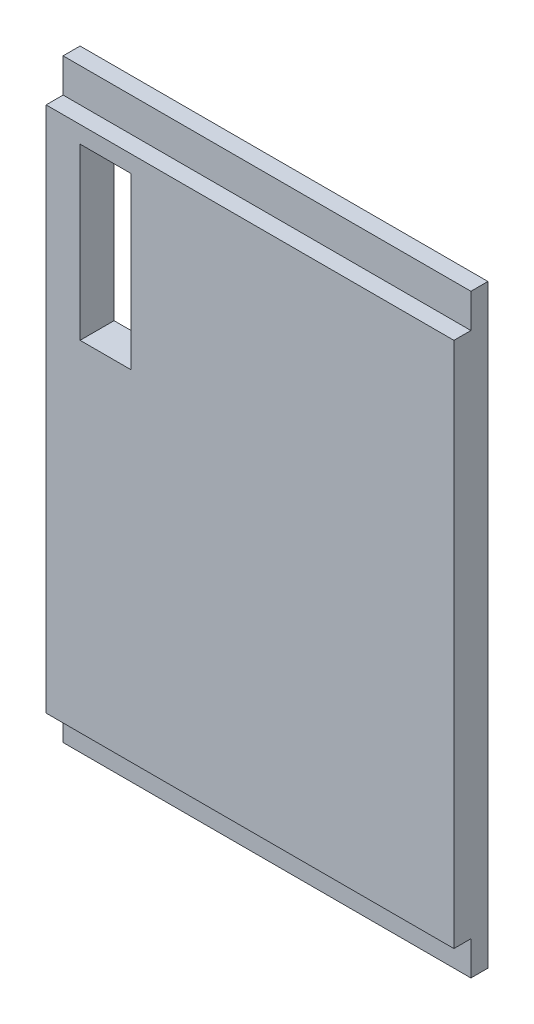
ISO-10303-21;
HEADER;
FILE_DESCRIPTION(('STEP AP214'),'2;1');
FILE_NAME('part.step','',(''),(''),'','','');
FILE_SCHEMA(('AUTOMOTIVE_DESIGN { 1 0 10303 214 1 1 1 1 }'));
ENDSEC;
DATA;
#1=APPLICATION_CONTEXT('core data for automotive mechanical design processes');
#2=APPLICATION_PROTOCOL_DEFINITION('international standard','automotive_design',2000,#1);
#3=PRODUCT_CONTEXT('',#1,'mechanical');
#4=PRODUCT('Part','Part','',(#3));
#5=PRODUCT_RELATED_PRODUCT_CATEGORY('part','',(#4));
#6=PRODUCT_DEFINITION_FORMATION('','',#4);
#7=PRODUCT_DEFINITION_CONTEXT('part definition',#1,'design');
#8=PRODUCT_DEFINITION('design','',#6,#7);
#9=PRODUCT_DEFINITION_SHAPE('','',#8);
#10=(LENGTH_UNIT() NAMED_UNIT(*) SI_UNIT(.MILLI.,.METRE.));
#11=(NAMED_UNIT(*) PLANE_ANGLE_UNIT() SI_UNIT($,.RADIAN.));
#12=(NAMED_UNIT(*) SI_UNIT($,.STERADIAN.) SOLID_ANGLE_UNIT());
#13=UNCERTAINTY_MEASURE_WITH_UNIT(LENGTH_MEASURE(1.E-05),#10,'distance_accuracy_value','');
#14=(GEOMETRIC_REPRESENTATION_CONTEXT(3) GLOBAL_UNCERTAINTY_ASSIGNED_CONTEXT((#13)) GLOBAL_UNIT_ASSIGNED_CONTEXT((#10,
#11,#12)) REPRESENTATION_CONTEXT('',''));
#15=CARTESIAN_POINT('',(0.,0.,0.));
#16=DIRECTION('',(0.,0.,1.));
#17=DIRECTION('',(1.,0.,0.));
#18=AXIS2_PLACEMENT_3D('',#15,#16,#17);
#19=CARTESIAN_POINT('',(0.,0.,1.));
#20=DIRECTION('',(0.,0.,-1.));
#21=DIRECTION('',(-1.,0.,0.));
#22=AXIS2_PLACEMENT_3D('',#19,#20,#21);
#23=PLANE('',#22);
#24=DIRECTION('',(1.,0.,0.));
#25=VECTOR('',#24,1.);
#26=CARTESIAN_POINT('',(-12.,-15.5,1.));
#27=LINE('',#26,#25);
#28=CARTESIAN_POINT('',(-12.,-15.5,1.));
#29=VERTEX_POINT('',#28);
#30=CARTESIAN_POINT('',(12.,-15.5,1.));
#31=VERTEX_POINT('',#30);
#32=EDGE_CURVE('E166',#29,#31,#27,.T.);
#33=ORIENTED_EDGE('',*,*,#32,.F.);
#34=DIRECTION('',(0.,-1.,0.));
#35=VECTOR('',#34,1.);
#36=CARTESIAN_POINT('',(-12.,-17.5,1.));
#37=LINE('',#36,#35);
#38=CARTESIAN_POINT('',(-12.,-17.5,1.));
#39=VERTEX_POINT('',#38);
#40=EDGE_CURVE('E194',#29,#39,#37,.T.);
#41=ORIENTED_EDGE('',*,*,#40,.T.);
#42=DIRECTION('',(1.,0.,0.));
#43=VECTOR('',#42,1.);
#44=CARTESIAN_POINT('',(-12.,-17.5,1.));
#45=LINE('',#44,#43);
#46=CARTESIAN_POINT('',(12.,-17.5,1.));
#47=VERTEX_POINT('',#46);
#48=EDGE_CURVE('E197',#39,#47,#45,.T.);
#49=ORIENTED_EDGE('',*,*,#48,.T.);
#50=DIRECTION('',(0.,1.,0.));
#51=VECTOR('',#50,1.);
#52=CARTESIAN_POINT('',(12.,-17.5,1.));
#53=LINE('',#52,#51);
#54=EDGE_CURVE('E189',#47,#31,#53,.T.);
#55=ORIENTED_EDGE('',*,*,#54,.T.);
#56=EDGE_LOOP('',(#33,#41,#49,#55));
#57=FACE_BOUND('',#56,.T.);
#58=ADVANCED_FACE('F36',(#57),#23,.F.);
#59=DIRECTION('',(-1.,0.,0.));
#60=VECTOR('',#59,1.);
#61=CARTESIAN_POINT('',(-12.,15.5,1.));
#62=LINE('',#61,#60);
#63=CARTESIAN_POINT('',(12.,15.5,1.));
#64=VERTEX_POINT('',#63);
#65=CARTESIAN_POINT('',(-12.,15.5,1.));
#66=VERTEX_POINT('',#65);
#67=EDGE_CURVE('E158',#64,#66,#62,.T.);
#68=ORIENTED_EDGE('',*,*,#67,.F.);
#69=CARTESIAN_POINT('',(12.,17.5,1.));
#70=VERTEX_POINT('',#69);
#71=EDGE_CURVE('E192',#64,#70,#53,.T.);
#72=ORIENTED_EDGE('',*,*,#71,.T.);
#73=DIRECTION('',(-1.,0.,0.));
#74=VECTOR('',#73,1.);
#75=CARTESIAN_POINT('',(-12.,17.5,1.));
#76=LINE('',#75,#74);
#77=CARTESIAN_POINT('',(-12.,17.5,1.));
#78=VERTEX_POINT('',#77);
#79=EDGE_CURVE('E191',#70,#78,#76,.T.);
#80=ORIENTED_EDGE('',*,*,#79,.T.);
#81=EDGE_CURVE('E195',#78,#66,#37,.T.);
#82=ORIENTED_EDGE('',*,*,#81,.T.);
#83=EDGE_LOOP('',(#68,#72,#80,#82));
#84=FACE_BOUND('',#83,.T.);
#85=ADVANCED_FACE('F247',(#84),#23,.F.);
#86=CARTESIAN_POINT('',(12.,-17.5,1.));
#87=DIRECTION('',(-1.,0.,0.));
#88=DIRECTION('',(0.,0.,1.));
#89=AXIS2_PLACEMENT_3D('',#86,#87,#88);
#90=PLANE('',#89);
#91=DIRECTION('',(0.,1.,0.));
#92=VECTOR('',#91,1.);
#93=CARTESIAN_POINT('',(12.,-17.5,0.));
#94=LINE('',#93,#92);
#95=CARTESIAN_POINT('',(12.,-17.5,0.));
#96=VERTEX_POINT('',#95);
#97=CARTESIAN_POINT('',(12.,17.5,0.));
#98=VERTEX_POINT('',#97);
#99=EDGE_CURVE('E188',#96,#98,#94,.T.);
#100=ORIENTED_EDGE('',*,*,#99,.T.);
#101=DIRECTION('',(0.,0.,-1.));
#102=VECTOR('',#101,1.);
#103=CARTESIAN_POINT('',(12.,17.5,1.));
#104=LINE('',#103,#102);
#105=EDGE_CURVE('E11',#70,#98,#104,.T.);
#106=ORIENTED_EDGE('',*,*,#105,.F.);
#107=ORIENTED_EDGE('',*,*,#71,.F.);
#108=DIRECTION('',(0.,0.,-1.));
#109=VECTOR('',#108,1.);
#110=CARTESIAN_POINT('',(12.,15.5,2.));
#111=LINE('',#110,#109);
#112=CARTESIAN_POINT('',(12.,15.5,2.));
#113=VERTEX_POINT('',#112);
#114=EDGE_CURVE('E185',#113,#64,#111,.T.);
#115=ORIENTED_EDGE('',*,*,#114,.F.);
#116=DIRECTION('',(0.,1.,0.));
#117=VECTOR('',#116,1.);
#118=CARTESIAN_POINT('',(12.,-15.5,2.));
#119=LINE('',#118,#117);
#120=CARTESIAN_POINT('',(12.,-15.5,2.));
#121=VERTEX_POINT('',#120);
#122=EDGE_CURVE('E162',#121,#113,#119,.T.);
#123=ORIENTED_EDGE('',*,*,#122,.F.);
#124=DIRECTION('',(0.,0.,-1.));
#125=VECTOR('',#124,1.);
#126=CARTESIAN_POINT('',(12.,-15.5,2.));
#127=LINE('',#126,#125);
#128=EDGE_CURVE('E172',#121,#31,#127,.T.);
#129=ORIENTED_EDGE('',*,*,#128,.T.);
#130=ORIENTED_EDGE('',*,*,#54,.F.);
#131=DIRECTION('',(0.,0.,-1.));
#132=VECTOR('',#131,1.);
#133=CARTESIAN_POINT('',(12.,-17.5,1.));
#134=LINE('',#133,#132);
#135=EDGE_CURVE('E199',#47,#96,#134,.T.);
#136=ORIENTED_EDGE('',*,*,#135,.T.);
#137=EDGE_LOOP('',(#100,#106,#107,#115,#123,#129,#130,#136));
#138=FACE_BOUND('',#137,.T.);
#139=ADVANCED_FACE('F38',(#138),#90,.F.);
#140=CARTESIAN_POINT('',(-12.,17.5,1.));
#141=DIRECTION('',(0.,-1.,0.));
#142=DIRECTION('',(0.,0.,-1.));
#143=AXIS2_PLACEMENT_3D('',#140,#141,#142);
#144=PLANE('',#143);
#145=DIRECTION('',(-1.,0.,0.));
#146=VECTOR('',#145,1.);
#147=CARTESIAN_POINT('',(-12.,17.5,0.));
#148=LINE('',#147,#146);
#149=CARTESIAN_POINT('',(-12.,17.5,0.));
#150=VERTEX_POINT('',#149);
#151=EDGE_CURVE('E202',#98,#150,#148,.T.);
#152=ORIENTED_EDGE('',*,*,#151,.T.);
#153=DIRECTION('',(0.,0.,-1.));
#154=VECTOR('',#153,1.);
#155=CARTESIAN_POINT('',(-12.,17.5,1.));
#156=LINE('',#155,#154);
#157=EDGE_CURVE('E44',#78,#150,#156,.T.);
#158=ORIENTED_EDGE('',*,*,#157,.F.);
#159=ORIENTED_EDGE('',*,*,#79,.F.);
#160=ORIENTED_EDGE('',*,*,#105,.T.);
#161=EDGE_LOOP('',(#152,#158,#159,#160));
#162=FACE_BOUND('',#161,.T.);
#163=ADVANCED_FACE('F248',(#162),#144,.F.);
#164=CARTESIAN_POINT('',(-12.,-17.5,1.));
#165=DIRECTION('',(1.,0.,0.));
#166=DIRECTION('',(0.,0.,-1.));
#167=AXIS2_PLACEMENT_3D('',#164,#165,#166);
#168=PLANE('',#167);
#169=DIRECTION('',(0.,-1.,0.));
#170=VECTOR('',#169,1.);
#171=CARTESIAN_POINT('',(-12.,-17.5,0.));
#172=LINE('',#171,#170);
#173=CARTESIAN_POINT('',(-12.,-17.5,0.));
#174=VERTEX_POINT('',#173);
#175=EDGE_CURVE('E204',#150,#174,#172,.T.);
#176=ORIENTED_EDGE('',*,*,#175,.T.);
#177=DIRECTION('',(0.,0.,-1.));
#178=VECTOR('',#177,1.);
#179=CARTESIAN_POINT('',(-12.,-17.5,1.));
#180=LINE('',#179,#178);
#181=EDGE_CURVE('E210',#39,#174,#180,.T.);
#182=ORIENTED_EDGE('',*,*,#181,.F.);
#183=ORIENTED_EDGE('',*,*,#40,.F.);
#184=DIRECTION('',(0.,0.,-1.));
#185=VECTOR('',#184,1.);
#186=CARTESIAN_POINT('',(-12.,-15.5,2.));
#187=LINE('',#186,#185);
#188=CARTESIAN_POINT('',(-12.,-15.5,2.));
#189=VERTEX_POINT('',#188);
#190=EDGE_CURVE('E179',#189,#29,#187,.T.);
#191=ORIENTED_EDGE('',*,*,#190,.F.);
#192=DIRECTION('',(0.,-1.,0.));
#193=VECTOR('',#192,1.);
#194=CARTESIAN_POINT('',(-12.,-15.5,2.));
#195=LINE('',#194,#193);
#196=CARTESIAN_POINT('',(-12.,15.5,2.));
#197=VERTEX_POINT('',#196);
#198=EDGE_CURVE('E168',#197,#189,#195,.T.);
#199=ORIENTED_EDGE('',*,*,#198,.F.);
#200=DIRECTION('',(0.,0.,-1.));
#201=VECTOR('',#200,1.);
#202=CARTESIAN_POINT('',(-12.,15.5,2.));
#203=LINE('',#202,#201);
#204=EDGE_CURVE('E182',#197,#66,#203,.T.);
#205=ORIENTED_EDGE('',*,*,#204,.T.);
#206=ORIENTED_EDGE('',*,*,#81,.F.);
#207=ORIENTED_EDGE('',*,*,#157,.T.);
#208=EDGE_LOOP('',(#176,#182,#183,#191,#199,#205,#206,#207));
#209=FACE_BOUND('',#208,.T.);
#210=ADVANCED_FACE('F217',(#209),#168,.F.);
#211=CARTESIAN_POINT('',(-12.,-17.5,1.));
#212=DIRECTION('',(0.,1.,0.));
#213=DIRECTION('',(0.,0.,1.));
#214=AXIS2_PLACEMENT_3D('',#211,#212,#213);
#215=PLANE('',#214);
#216=DIRECTION('',(1.,0.,0.));
#217=VECTOR('',#216,1.);
#218=CARTESIAN_POINT('',(-12.,-17.5,0.));
#219=LINE('',#218,#217);
#220=EDGE_CURVE('E206',#174,#96,#219,.T.);
#221=ORIENTED_EDGE('',*,*,#220,.T.);
#222=ORIENTED_EDGE('',*,*,#135,.F.);
#223=ORIENTED_EDGE('',*,*,#48,.F.);
#224=ORIENTED_EDGE('',*,*,#181,.T.);
#225=EDGE_LOOP('',(#221,#222,#223,#224));
#226=FACE_BOUND('',#225,.T.);
#227=ADVANCED_FACE('F227',(#226),#215,.F.);
#228=CARTESIAN_POINT('',(0.,0.,0.));
#229=DIRECTION('',(0.,0.,-1.));
#230=DIRECTION('',(-1.,0.,0.));
#231=AXIS2_PLACEMENT_3D('',#228,#229,#230);
#232=PLANE('',#231);
#233=DIRECTION('',(0.,-1.,0.));
#234=VECTOR('',#233,1.);
#235=CARTESIAN_POINT('',(-7.,14.5,0.));
#236=LINE('',#235,#234);
#237=CARTESIAN_POINT('',(-7.,14.5,0.));
#238=VERTEX_POINT('',#237);
#239=CARTESIAN_POINT('',(-7.,4.5,0.));
#240=VERTEX_POINT('',#239);
#241=EDGE_CURVE('E51',#238,#240,#236,.T.);
#242=ORIENTED_EDGE('',*,*,#241,.F.);
#243=DIRECTION('',(1.,0.,0.));
#244=VECTOR('',#243,1.);
#245=CARTESIAN_POINT('',(-7.,14.5,0.));
#246=LINE('',#245,#244);
#247=CARTESIAN_POINT('',(-10.,14.5,0.));
#248=VERTEX_POINT('',#247);
#249=EDGE_CURVE('E143',#248,#238,#246,.T.);
#250=ORIENTED_EDGE('',*,*,#249,.F.);
#251=DIRECTION('',(0.,1.,0.));
#252=VECTOR('',#251,1.);
#253=CARTESIAN_POINT('',(-10.,14.5,0.));
#254=LINE('',#253,#252);
#255=CARTESIAN_POINT('',(-10.,4.5,0.));
#256=VERTEX_POINT('',#255);
#257=EDGE_CURVE('E146',#256,#248,#254,.T.);
#258=ORIENTED_EDGE('',*,*,#257,.F.);
#259=DIRECTION('',(-1.,0.,0.));
#260=VECTOR('',#259,1.);
#261=CARTESIAN_POINT('',(-7.,4.5,0.));
#262=LINE('',#261,#260);
#263=EDGE_CURVE('E152',#240,#256,#262,.T.);
#264=ORIENTED_EDGE('',*,*,#263,.F.);
#265=EDGE_LOOP('',(#242,#250,#258,#264));
#266=FACE_BOUND('',#265,.T.);
#267=ORIENTED_EDGE('',*,*,#99,.F.);
#268=ORIENTED_EDGE('',*,*,#220,.F.);
#269=ORIENTED_EDGE('',*,*,#175,.F.);
#270=ORIENTED_EDGE('',*,*,#151,.F.);
#271=EDGE_LOOP('',(#267,#268,#269,#270));
#272=FACE_BOUND('',#271,.T.);
#273=ADVANCED_FACE('F224',(#266,#272),#232,.T.);
#274=CARTESIAN_POINT('',(-12.,15.5,2.));
#275=DIRECTION('',(0.,-1.,0.));
#276=DIRECTION('',(0.,0.,-1.));
#277=AXIS2_PLACEMENT_3D('',#274,#275,#276);
#278=PLANE('',#277);
#279=ORIENTED_EDGE('',*,*,#67,.T.);
#280=ORIENTED_EDGE('',*,*,#204,.F.);
#281=DIRECTION('',(-1.,0.,0.));
#282=VECTOR('',#281,1.);
#283=CARTESIAN_POINT('',(-12.,15.5,2.));
#284=LINE('',#283,#282);
#285=EDGE_CURVE('E165',#113,#197,#284,.T.);
#286=ORIENTED_EDGE('',*,*,#285,.F.);
#287=ORIENTED_EDGE('',*,*,#114,.T.);
#288=EDGE_LOOP('',(#279,#280,#286,#287));
#289=FACE_BOUND('',#288,.T.);
#290=ADVANCED_FACE('F244',(#289),#278,.F.);
#291=CARTESIAN_POINT('',(-12.,-15.5,2.));
#292=DIRECTION('',(0.,1.,0.));
#293=DIRECTION('',(0.,0.,1.));
#294=AXIS2_PLACEMENT_3D('',#291,#292,#293);
#295=PLANE('',#294);
#296=ORIENTED_EDGE('',*,*,#32,.T.);
#297=ORIENTED_EDGE('',*,*,#128,.F.);
#298=DIRECTION('',(1.,0.,0.));
#299=VECTOR('',#298,1.);
#300=CARTESIAN_POINT('',(-12.,-15.5,2.));
#301=LINE('',#300,#299);
#302=EDGE_CURVE('E170',#189,#121,#301,.T.);
#303=ORIENTED_EDGE('',*,*,#302,.F.);
#304=ORIENTED_EDGE('',*,*,#190,.T.);
#305=EDGE_LOOP('',(#296,#297,#303,#304));
#306=FACE_BOUND('',#305,.T.);
#307=ADVANCED_FACE('F237',(#306),#295,.F.);
#308=CARTESIAN_POINT('',(0.,0.,2.));
#309=DIRECTION('',(0.,0.,-1.));
#310=DIRECTION('',(-1.,0.,0.));
#311=AXIS2_PLACEMENT_3D('',#308,#309,#310);
#312=PLANE('',#311);
#313=DIRECTION('',(1.,0.,0.));
#314=VECTOR('',#313,1.);
#315=CARTESIAN_POINT('',(-7.,14.5,2.));
#316=LINE('',#315,#314);
#317=CARTESIAN_POINT('',(-10.,14.5,2.));
#318=VERTEX_POINT('',#317);
#319=CARTESIAN_POINT('',(-7.,14.5,2.));
#320=VERTEX_POINT('',#319);
#321=EDGE_CURVE('E133',#318,#320,#316,.T.);
#322=ORIENTED_EDGE('',*,*,#321,.T.);
#323=DIRECTION('',(0.,-1.,0.));
#324=VECTOR('',#323,1.);
#325=CARTESIAN_POINT('',(-7.,14.5,2.));
#326=LINE('',#325,#324);
#327=CARTESIAN_POINT('',(-7.,4.5,2.));
#328=VERTEX_POINT('',#327);
#329=EDGE_CURVE('E127',#320,#328,#326,.T.);
#330=ORIENTED_EDGE('',*,*,#329,.T.);
#331=DIRECTION('',(-1.,0.,0.));
#332=VECTOR('',#331,1.);
#333=CARTESIAN_POINT('',(-7.,4.5,2.));
#334=LINE('',#333,#332);
#335=CARTESIAN_POINT('',(-10.,4.5,2.));
#336=VERTEX_POINT('',#335);
#337=EDGE_CURVE('E136',#328,#336,#334,.T.);
#338=ORIENTED_EDGE('',*,*,#337,.T.);
#339=DIRECTION('',(0.,1.,0.));
#340=VECTOR('',#339,1.);
#341=CARTESIAN_POINT('',(-10.,14.5,2.));
#342=LINE('',#341,#340);
#343=EDGE_CURVE('E59',#336,#318,#342,.T.);
#344=ORIENTED_EDGE('',*,*,#343,.T.);
#345=EDGE_LOOP('',(#322,#330,#338,#344));
#346=FACE_BOUND('',#345,.T.);
#347=ORIENTED_EDGE('',*,*,#122,.T.);
#348=ORIENTED_EDGE('',*,*,#285,.T.);
#349=ORIENTED_EDGE('',*,*,#198,.T.);
#350=ORIENTED_EDGE('',*,*,#302,.T.);
#351=EDGE_LOOP('',(#347,#348,#349,#350));
#352=FACE_BOUND('',#351,.T.);
#353=ADVANCED_FACE('F140',(#346,#352),#312,.F.);
#354=CARTESIAN_POINT('',(-7.,14.5,2.));
#355=DIRECTION('',(1.,0.,0.));
#356=DIRECTION('',(0.,1.,0.));
#357=AXIS2_PLACEMENT_3D('',#354,#355,#356);
#358=PLANE('',#357);
#359=ORIENTED_EDGE('',*,*,#241,.T.);
#360=DIRECTION('',(0.,0.,-1.));
#361=VECTOR('',#360,1.);
#362=CARTESIAN_POINT('',(-7.,4.5,2.));
#363=LINE('',#362,#361);
#364=EDGE_CURVE('E123',#328,#240,#363,.T.);
#365=ORIENTED_EDGE('',*,*,#364,.F.);
#366=ORIENTED_EDGE('',*,*,#329,.F.);
#367=DIRECTION('',(0.,0.,-1.));
#368=VECTOR('',#367,1.);
#369=CARTESIAN_POINT('',(-7.,14.5,2.));
#370=LINE('',#369,#368);
#371=EDGE_CURVE('E156',#320,#238,#370,.T.);
#372=ORIENTED_EDGE('',*,*,#371,.T.);
#373=EDGE_LOOP('',(#359,#365,#366,#372));
#374=FACE_BOUND('',#373,.T.);
#375=ADVANCED_FACE('F125',(#374),#358,.F.);
#376=CARTESIAN_POINT('',(-7.,14.5,2.));
#377=DIRECTION('',(0.,1.,0.));
#378=DIRECTION('',(0.,0.,1.));
#379=AXIS2_PLACEMENT_3D('',#376,#377,#378);
#380=PLANE('',#379);
#381=ORIENTED_EDGE('',*,*,#249,.T.);
#382=ORIENTED_EDGE('',*,*,#371,.F.);
#383=ORIENTED_EDGE('',*,*,#321,.F.);
#384=DIRECTION('',(0.,0.,-1.));
#385=VECTOR('',#384,1.);
#386=CARTESIAN_POINT('',(-10.,14.5,2.));
#387=LINE('',#386,#385);
#388=EDGE_CURVE('E159',#318,#248,#387,.T.);
#389=ORIENTED_EDGE('',*,*,#388,.T.);
#390=EDGE_LOOP('',(#381,#382,#383,#389));
#391=FACE_BOUND('',#390,.T.);
#392=ADVANCED_FACE('F297',(#391),#380,.F.);
#393=CARTESIAN_POINT('',(-10.,14.5,2.));
#394=DIRECTION('',(-1.,0.,0.));
#395=DIRECTION('',(0.,-1.,0.));
#396=AXIS2_PLACEMENT_3D('',#393,#394,#395);
#397=PLANE('',#396);
#398=ORIENTED_EDGE('',*,*,#257,.T.);
#399=ORIENTED_EDGE('',*,*,#388,.F.);
#400=ORIENTED_EDGE('',*,*,#343,.F.);
#401=DIRECTION('',(0.,0.,-1.));
#402=VECTOR('',#401,1.);
#403=CARTESIAN_POINT('',(-10.,4.5,2.));
#404=LINE('',#403,#402);
#405=EDGE_CURVE('E132',#336,#256,#404,.T.);
#406=ORIENTED_EDGE('',*,*,#405,.T.);
#407=EDGE_LOOP('',(#398,#399,#400,#406));
#408=FACE_BOUND('',#407,.T.);
#409=ADVANCED_FACE('F304',(#408),#397,.F.);
#410=CARTESIAN_POINT('',(-7.,4.5,2.));
#411=DIRECTION('',(0.,-1.,0.));
#412=DIRECTION('',(0.,0.,-1.));
#413=AXIS2_PLACEMENT_3D('',#410,#411,#412);
#414=PLANE('',#413);
#415=ORIENTED_EDGE('',*,*,#263,.T.);
#416=ORIENTED_EDGE('',*,*,#405,.F.);
#417=ORIENTED_EDGE('',*,*,#337,.F.);
#418=ORIENTED_EDGE('',*,*,#364,.T.);
#419=EDGE_LOOP('',(#415,#416,#417,#418));
#420=FACE_BOUND('',#419,.T.);
#421=ADVANCED_FACE('F137',(#420),#414,.F.);
#422=CLOSED_SHELL('',(#58,#85,#139,#163,#210,#227,#273,#290,#307,#353,#375,#392,#409,#421));
#423=MANIFOLD_SOLID_BREP('B2',#422);
#424=ADVANCED_BREP_SHAPE_REPRESENTATION('',(#18,#423),#14);
#425=SHAPE_DEFINITION_REPRESENTATION(#9,#424);
ENDSEC;
END-ISO-10303-21;
